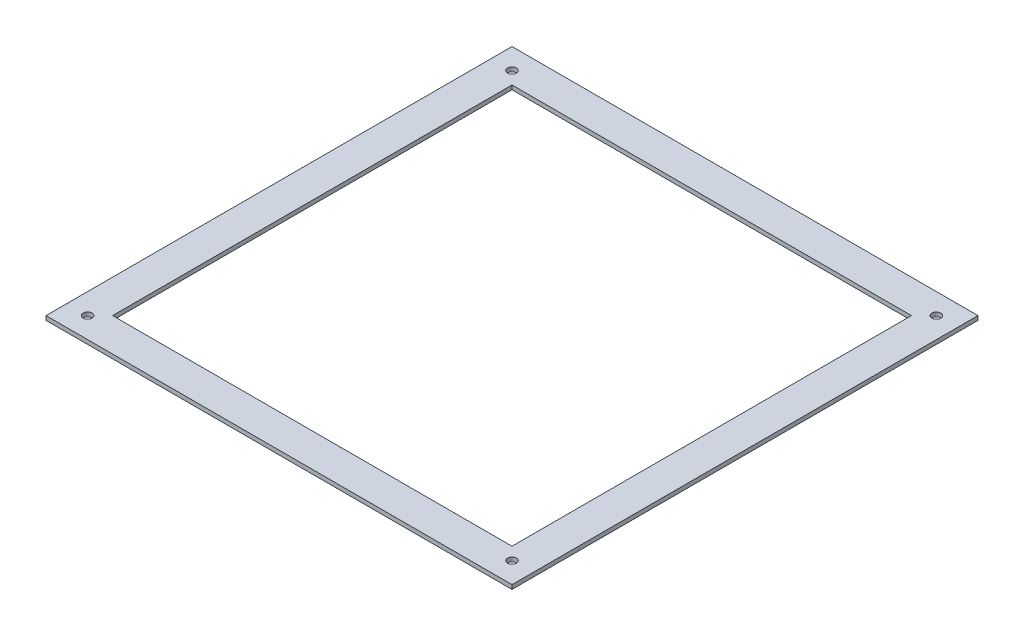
ISO-10303-21;
HEADER;
FILE_DESCRIPTION(('STEP AP214'),'2;1');
FILE_NAME('part.step','',(''),(''),'','','');
FILE_SCHEMA(('AUTOMOTIVE_DESIGN { 1 0 10303 214 1 1 1 1 }'));
ENDSEC;
DATA;
#1=APPLICATION_CONTEXT('core data for automotive mechanical design processes');
#2=APPLICATION_PROTOCOL_DEFINITION('international standard','automotive_design',2000,#1);
#3=PRODUCT_CONTEXT('',#1,'mechanical');
#4=PRODUCT('Part','Part','',(#3));
#5=PRODUCT_RELATED_PRODUCT_CATEGORY('part','',(#4));
#6=PRODUCT_DEFINITION_FORMATION('','',#4);
#7=PRODUCT_DEFINITION_CONTEXT('part definition',#1,'design');
#8=PRODUCT_DEFINITION('design','',#6,#7);
#9=PRODUCT_DEFINITION_SHAPE('','',#8);
#10=(LENGTH_UNIT() NAMED_UNIT(*) SI_UNIT(.MILLI.,.METRE.));
#11=(NAMED_UNIT(*) PLANE_ANGLE_UNIT() SI_UNIT($,.RADIAN.));
#12=(NAMED_UNIT(*) SI_UNIT($,.STERADIAN.) SOLID_ANGLE_UNIT());
#13=UNCERTAINTY_MEASURE_WITH_UNIT(LENGTH_MEASURE(1.E-05),#10,'distance_accuracy_value','');
#14=(GEOMETRIC_REPRESENTATION_CONTEXT(3) GLOBAL_UNCERTAINTY_ASSIGNED_CONTEXT((#13)) GLOBAL_UNIT_ASSIGNED_CONTEXT((#10,
#11,#12)) REPRESENTATION_CONTEXT('',''));
#15=CARTESIAN_POINT('',(0.,0.,0.));
#16=DIRECTION('',(0.,0.,1.));
#17=DIRECTION('',(1.,0.,0.));
#18=AXIS2_PLACEMENT_3D('',#15,#16,#17);
#19=CARTESIAN_POINT('',(177.799999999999,3.175,-177.8));
#20=DIRECTION('',(0.,-1.,0.));
#21=DIRECTION('',(0.,0.,-1.));
#22=AXIS2_PLACEMENT_3D('',#19,#20,#21);
#23=PLANE('',#22);
#24=CARTESIAN_POINT('',(-161.925,3.175,161.925));
#25=DIRECTION('',(0.,1.,0.));
#26=DIRECTION('',(0.,0.,1.));
#27=AXIS2_PLACEMENT_3D('',#24,#25,#26);
#28=CIRCLE('',#27,3.3782);
#29=CARTESIAN_POINT('',(-161.925,3.175,165.3032));
#30=VERTEX_POINT('',#29);
#31=EDGE_CURVE('E238',#30,#30,#28,.T.);
#32=ORIENTED_EDGE('',*,*,#31,.F.);
#33=EDGE_LOOP('',(#32));
#34=FACE_BOUND('',#33,.T.);
#35=CARTESIAN_POINT('',(161.925,3.175,161.925));
#36=DIRECTION('',(0.,1.,0.));
#37=DIRECTION('',(0.,0.,1.));
#38=AXIS2_PLACEMENT_3D('',#35,#36,#37);
#39=CIRCLE('',#38,3.3782);
#40=CARTESIAN_POINT('',(161.925,3.175,165.3032));
#41=VERTEX_POINT('',#40);
#42=EDGE_CURVE('E240',#41,#41,#39,.T.);
#43=ORIENTED_EDGE('',*,*,#42,.F.);
#44=EDGE_LOOP('',(#43));
#45=FACE_BOUND('',#44,.T.);
#46=CARTESIAN_POINT('',(161.925,3.175,-161.925));
#47=DIRECTION('',(0.,1.,0.));
#48=DIRECTION('',(0.,0.,1.));
#49=AXIS2_PLACEMENT_3D('',#46,#47,#48);
#50=CIRCLE('',#49,3.3782);
#51=CARTESIAN_POINT('',(161.925,3.175,-158.5468));
#52=VERTEX_POINT('',#51);
#53=EDGE_CURVE('E247',#52,#52,#50,.T.);
#54=ORIENTED_EDGE('',*,*,#53,.F.);
#55=EDGE_LOOP('',(#54));
#56=FACE_BOUND('',#55,.T.);
#57=CARTESIAN_POINT('',(-161.925,3.175,-161.925));
#58=DIRECTION('',(0.,1.,0.));
#59=DIRECTION('',(0.,0.,1.));
#60=AXIS2_PLACEMENT_3D('',#57,#58,#59);
#61=CIRCLE('',#60,3.3782);
#62=CARTESIAN_POINT('',(-161.925,3.175,-158.5468));
#63=VERTEX_POINT('',#62);
#64=EDGE_CURVE('E253',#63,#63,#61,.T.);
#65=ORIENTED_EDGE('',*,*,#64,.F.);
#66=EDGE_LOOP('',(#65));
#67=FACE_BOUND('',#66,.T.);
#68=DIRECTION('',(0.,0.,-1.));
#69=VECTOR('',#68,1.);
#70=CARTESIAN_POINT('',(177.799999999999,3.175,177.8));
#71=LINE('',#70,#69);
#72=CARTESIAN_POINT('',(177.799999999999,3.175,177.8));
#73=VERTEX_POINT('',#72);
#74=CARTESIAN_POINT('',(177.799999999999,3.175,-177.8));
#75=VERTEX_POINT('',#74);
#76=EDGE_CURVE('E136',#73,#75,#71,.T.);
#77=ORIENTED_EDGE('',*,*,#76,.T.);
#78=DIRECTION('',(-1.,0.,0.));
#79=VECTOR('',#78,1.);
#80=CARTESIAN_POINT('',(-177.799999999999,3.175,-177.8));
#81=LINE('',#80,#79);
#82=CARTESIAN_POINT('',(-177.799999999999,3.175,-177.8));
#83=VERTEX_POINT('',#82);
#84=EDGE_CURVE('E139',#75,#83,#81,.T.);
#85=ORIENTED_EDGE('',*,*,#84,.T.);
#86=DIRECTION('',(0.,0.,1.));
#87=VECTOR('',#86,1.);
#88=CARTESIAN_POINT('',(-177.799999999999,3.175,177.8));
#89=LINE('',#88,#87);
#90=CARTESIAN_POINT('',(-177.799999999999,3.175,177.8));
#91=VERTEX_POINT('',#90);
#92=EDGE_CURVE('E142',#83,#91,#89,.T.);
#93=ORIENTED_EDGE('',*,*,#92,.T.);
#94=DIRECTION('',(1.,0.,0.));
#95=VECTOR('',#94,1.);
#96=CARTESIAN_POINT('',(-177.799999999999,3.175,177.8));
#97=LINE('',#96,#95);
#98=EDGE_CURVE('E144',#91,#73,#97,.T.);
#99=ORIENTED_EDGE('',*,*,#98,.T.);
#100=EDGE_LOOP('',(#77,#85,#93,#99));
#101=FACE_BOUND('',#100,.T.);
#102=DIRECTION('',(0.,0.,-1.));
#103=VECTOR('',#102,1.);
#104=CARTESIAN_POINT('',(152.399999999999,3.175,152.4));
#105=LINE('',#104,#103);
#106=CARTESIAN_POINT('',(152.399999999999,3.175,152.4));
#107=VERTEX_POINT('',#106);
#108=CARTESIAN_POINT('',(152.399999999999,3.175,-152.399999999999));
#109=VERTEX_POINT('',#108);
#110=EDGE_CURVE('E98',#107,#109,#105,.T.);
#111=ORIENTED_EDGE('',*,*,#110,.F.);
#112=DIRECTION('',(1.,0.,0.));
#113=VECTOR('',#112,1.);
#114=CARTESIAN_POINT('',(-152.4,3.175,152.4));
#115=LINE('',#114,#113);
#116=CARTESIAN_POINT('',(-152.4,3.175,152.4));
#117=VERTEX_POINT('',#116);
#118=EDGE_CURVE('E120',#117,#107,#115,.T.);
#119=ORIENTED_EDGE('',*,*,#118,.F.);
#120=DIRECTION('',(0.,0.,1.));
#121=VECTOR('',#120,1.);
#122=CARTESIAN_POINT('',(-152.4,3.175,152.4));
#123=LINE('',#122,#121);
#124=CARTESIAN_POINT('',(-152.4,3.175,-152.4));
#125=VERTEX_POINT('',#124);
#126=EDGE_CURVE('E118',#125,#117,#123,.T.);
#127=ORIENTED_EDGE('',*,*,#126,.F.);
#128=DIRECTION('',(-1.,0.,0.));
#129=VECTOR('',#128,1.);
#130=CARTESIAN_POINT('',(-152.4,3.175,-152.4));
#131=LINE('',#130,#129);
#132=EDGE_CURVE('E106',#109,#125,#131,.T.);
#133=ORIENTED_EDGE('',*,*,#132,.F.);
#134=EDGE_LOOP('',(#111,#119,#127,#133));
#135=FACE_BOUND('',#134,.T.);
#136=ADVANCED_FACE('F32',(#34,#45,#56,#67,#101,#135),#23,.F.);
#137=CARTESIAN_POINT('',(177.799999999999,0.,-177.8));
#138=DIRECTION('',(0.,-1.,0.));
#139=DIRECTION('',(0.,0.,-1.));
#140=AXIS2_PLACEMENT_3D('',#137,#138,#139);
#141=PLANE('',#140);
#142=CARTESIAN_POINT('',(-161.925,0.,161.925));
#143=DIRECTION('',(0.,-1.,0.));
#144=DIRECTION('',(0.,0.,-1.));
#145=AXIS2_PLACEMENT_3D('',#142,#143,#144);
#146=CIRCLE('',#145,3.3782);
#147=CARTESIAN_POINT('',(-161.925,0.,158.5468));
#148=VERTEX_POINT('',#147);
#149=EDGE_CURVE('E36',#148,#148,#146,.T.);
#150=ORIENTED_EDGE('',*,*,#149,.F.);
#151=EDGE_LOOP('',(#150));
#152=FACE_BOUND('',#151,.T.);
#153=CARTESIAN_POINT('',(161.925,0.,161.925));
#154=DIRECTION('',(0.,-1.,0.));
#155=DIRECTION('',(0.,0.,-1.));
#156=AXIS2_PLACEMENT_3D('',#153,#154,#155);
#157=CIRCLE('',#156,3.3782);
#158=CARTESIAN_POINT('',(161.925,0.,158.5468));
#159=VERTEX_POINT('',#158);
#160=EDGE_CURVE('E244',#159,#159,#157,.T.);
#161=ORIENTED_EDGE('',*,*,#160,.F.);
#162=EDGE_LOOP('',(#161));
#163=FACE_BOUND('',#162,.T.);
#164=CARTESIAN_POINT('',(161.925,0.,-161.925));
#165=DIRECTION('',(0.,-1.,0.));
#166=DIRECTION('',(0.,0.,-1.));
#167=AXIS2_PLACEMENT_3D('',#164,#165,#166);
#168=CIRCLE('',#167,3.3782);
#169=CARTESIAN_POINT('',(161.925,0.,-165.3032));
#170=VERTEX_POINT('',#169);
#171=EDGE_CURVE('E250',#170,#170,#168,.T.);
#172=ORIENTED_EDGE('',*,*,#171,.F.);
#173=EDGE_LOOP('',(#172));
#174=FACE_BOUND('',#173,.T.);
#175=CARTESIAN_POINT('',(-161.925,0.,-161.925));
#176=DIRECTION('',(0.,-1.,0.));
#177=DIRECTION('',(0.,0.,-1.));
#178=AXIS2_PLACEMENT_3D('',#175,#176,#177);
#179=CIRCLE('',#178,3.3782);
#180=CARTESIAN_POINT('',(-161.925,0.,-165.3032));
#181=VERTEX_POINT('',#180);
#182=EDGE_CURVE('E126',#181,#181,#179,.T.);
#183=ORIENTED_EDGE('',*,*,#182,.F.);
#184=EDGE_LOOP('',(#183));
#185=FACE_BOUND('',#184,.T.);
#186=DIRECTION('',(0.,0.,-1.));
#187=VECTOR('',#186,1.);
#188=CARTESIAN_POINT('',(177.799999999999,0.,177.8));
#189=LINE('',#188,#187);
#190=CARTESIAN_POINT('',(177.799999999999,0.,177.8));
#191=VERTEX_POINT('',#190);
#192=CARTESIAN_POINT('',(177.799999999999,0.,-177.8));
#193=VERTEX_POINT('',#192);
#194=EDGE_CURVE('E114',#191,#193,#189,.T.);
#195=ORIENTED_EDGE('',*,*,#194,.F.);
#196=DIRECTION('',(1.,0.,0.));
#197=VECTOR('',#196,1.);
#198=CARTESIAN_POINT('',(-177.799999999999,0.,177.8));
#199=LINE('',#198,#197);
#200=CARTESIAN_POINT('',(-177.799999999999,0.,177.8));
#201=VERTEX_POINT('',#200);
#202=EDGE_CURVE('E140',#201,#191,#199,.T.);
#203=ORIENTED_EDGE('',*,*,#202,.F.);
#204=DIRECTION('',(0.,0.,1.));
#205=VECTOR('',#204,1.);
#206=CARTESIAN_POINT('',(-177.799999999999,0.,177.8));
#207=LINE('',#206,#205);
#208=CARTESIAN_POINT('',(-177.799999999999,0.,-177.8));
#209=VERTEX_POINT('',#208);
#210=EDGE_CURVE('E151',#209,#201,#207,.T.);
#211=ORIENTED_EDGE('',*,*,#210,.F.);
#212=DIRECTION('',(-1.,0.,0.));
#213=VECTOR('',#212,1.);
#214=CARTESIAN_POINT('',(-177.799999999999,0.,-177.8));
#215=LINE('',#214,#213);
#216=EDGE_CURVE('E149',#193,#209,#215,.T.);
#217=ORIENTED_EDGE('',*,*,#216,.F.);
#218=EDGE_LOOP('',(#195,#203,#211,#217));
#219=FACE_BOUND('',#218,.T.);
#220=DIRECTION('',(1.,0.,0.));
#221=VECTOR('',#220,1.);
#222=CARTESIAN_POINT('',(-152.4,0.,152.4));
#223=LINE('',#222,#221);
#224=CARTESIAN_POINT('',(-152.4,0.,152.4));
#225=VERTEX_POINT('',#224);
#226=CARTESIAN_POINT('',(152.399999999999,0.,152.4));
#227=VERTEX_POINT('',#226);
#228=EDGE_CURVE('E107',#225,#227,#223,.T.);
#229=ORIENTED_EDGE('',*,*,#228,.T.);
#230=DIRECTION('',(0.,0.,-1.));
#231=VECTOR('',#230,1.);
#232=CARTESIAN_POINT('',(152.399999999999,0.,152.4));
#233=LINE('',#232,#231);
#234=CARTESIAN_POINT('',(152.399999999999,0.,-152.399999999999));
#235=VERTEX_POINT('',#234);
#236=EDGE_CURVE('E56',#227,#235,#233,.T.);
#237=ORIENTED_EDGE('',*,*,#236,.T.);
#238=DIRECTION('',(-1.,0.,0.));
#239=VECTOR('',#238,1.);
#240=CARTESIAN_POINT('',(-152.4,0.,-152.4));
#241=LINE('',#240,#239);
#242=CARTESIAN_POINT('',(-152.4,0.,-152.4));
#243=VERTEX_POINT('',#242);
#244=EDGE_CURVE('E113',#235,#243,#241,.T.);
#245=ORIENTED_EDGE('',*,*,#244,.T.);
#246=DIRECTION('',(0.,0.,1.));
#247=VECTOR('',#246,1.);
#248=CARTESIAN_POINT('',(-152.4,0.,152.4));
#249=LINE('',#248,#247);
#250=EDGE_CURVE('E128',#243,#225,#249,.T.);
#251=ORIENTED_EDGE('',*,*,#250,.T.);
#252=EDGE_LOOP('',(#229,#237,#245,#251));
#253=FACE_BOUND('',#252,.T.);
#254=ADVANCED_FACE('F170',(#152,#163,#174,#185,#219,#253),#141,.T.);
#255=CARTESIAN_POINT('',(177.799999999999,3.175,177.8));
#256=DIRECTION('',(-1.,0.,0.));
#257=DIRECTION('',(0.,0.,1.));
#258=AXIS2_PLACEMENT_3D('',#255,#256,#257);
#259=PLANE('',#258);
#260=ORIENTED_EDGE('',*,*,#194,.T.);
#261=DIRECTION('',(0.,-1.,0.));
#262=VECTOR('',#261,1.);
#263=CARTESIAN_POINT('',(177.799999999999,3.175,-177.8));
#264=LINE('',#263,#262);
#265=EDGE_CURVE('E11',#75,#193,#264,.T.);
#266=ORIENTED_EDGE('',*,*,#265,.F.);
#267=ORIENTED_EDGE('',*,*,#76,.F.);
#268=DIRECTION('',(0.,-1.,0.));
#269=VECTOR('',#268,1.);
#270=CARTESIAN_POINT('',(177.799999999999,3.175,177.8));
#271=LINE('',#270,#269);
#272=EDGE_CURVE('E146',#73,#191,#271,.T.);
#273=ORIENTED_EDGE('',*,*,#272,.T.);
#274=EDGE_LOOP('',(#260,#266,#267,#273));
#275=FACE_BOUND('',#274,.T.);
#276=ADVANCED_FACE('F34',(#275),#259,.F.);
#277=CARTESIAN_POINT('',(-177.799999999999,3.175,-177.8));
#278=DIRECTION('',(0.,0.,1.));
#279=DIRECTION('',(1.,0.,0.));
#280=AXIS2_PLACEMENT_3D('',#277,#278,#279);
#281=PLANE('',#280);
#282=ORIENTED_EDGE('',*,*,#216,.T.);
#283=DIRECTION('',(0.,-1.,0.));
#284=VECTOR('',#283,1.);
#285=CARTESIAN_POINT('',(-177.799999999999,3.175,-177.8));
#286=LINE('',#285,#284);
#287=EDGE_CURVE('E41',#83,#209,#286,.T.);
#288=ORIENTED_EDGE('',*,*,#287,.F.);
#289=ORIENTED_EDGE('',*,*,#84,.F.);
#290=ORIENTED_EDGE('',*,*,#265,.T.);
#291=EDGE_LOOP('',(#282,#288,#289,#290));
#292=FACE_BOUND('',#291,.T.);
#293=ADVANCED_FACE('F180',(#292),#281,.F.);
#294=CARTESIAN_POINT('',(-177.799999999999,3.175,177.8));
#295=DIRECTION('',(1.,0.,0.));
#296=DIRECTION('',(0.,0.,-1.));
#297=AXIS2_PLACEMENT_3D('',#294,#295,#296);
#298=PLANE('',#297);
#299=ORIENTED_EDGE('',*,*,#210,.T.);
#300=DIRECTION('',(0.,-1.,0.));
#301=VECTOR('',#300,1.);
#302=CARTESIAN_POINT('',(-177.799999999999,3.175,177.8));
#303=LINE('',#302,#301);
#304=EDGE_CURVE('E156',#91,#201,#303,.T.);
#305=ORIENTED_EDGE('',*,*,#304,.F.);
#306=ORIENTED_EDGE('',*,*,#92,.F.);
#307=ORIENTED_EDGE('',*,*,#287,.T.);
#308=EDGE_LOOP('',(#299,#305,#306,#307));
#309=FACE_BOUND('',#308,.T.);
#310=ADVANCED_FACE('F164',(#309),#298,.F.);
#311=CARTESIAN_POINT('',(-177.799999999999,3.175,177.8));
#312=DIRECTION('',(0.,0.,-1.));
#313=DIRECTION('',(-1.,0.,0.));
#314=AXIS2_PLACEMENT_3D('',#311,#312,#313);
#315=PLANE('',#314);
#316=ORIENTED_EDGE('',*,*,#202,.T.);
#317=ORIENTED_EDGE('',*,*,#272,.F.);
#318=ORIENTED_EDGE('',*,*,#98,.F.);
#319=ORIENTED_EDGE('',*,*,#304,.T.);
#320=EDGE_LOOP('',(#316,#317,#318,#319));
#321=FACE_BOUND('',#320,.T.);
#322=ADVANCED_FACE('F174',(#321),#315,.F.);
#323=CARTESIAN_POINT('',(152.399999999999,3.175,152.4));
#324=DIRECTION('',(-1.,0.,0.));
#325=DIRECTION('',(0.,0.,1.));
#326=AXIS2_PLACEMENT_3D('',#323,#324,#325);
#327=PLANE('',#326);
#328=ORIENTED_EDGE('',*,*,#236,.F.);
#329=DIRECTION('',(0.,-1.,0.));
#330=VECTOR('',#329,1.);
#331=CARTESIAN_POINT('',(152.399999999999,3.175,152.4));
#332=LINE('',#331,#330);
#333=EDGE_CURVE('E102',#107,#227,#332,.T.);
#334=ORIENTED_EDGE('',*,*,#333,.F.);
#335=ORIENTED_EDGE('',*,*,#110,.T.);
#336=DIRECTION('',(0.,-1.,0.));
#337=VECTOR('',#336,1.);
#338=CARTESIAN_POINT('',(152.399999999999,3.175,-152.399999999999));
#339=LINE('',#338,#337);
#340=EDGE_CURVE('E101',#109,#235,#339,.T.);
#341=ORIENTED_EDGE('',*,*,#340,.T.);
#342=EDGE_LOOP('',(#328,#334,#335,#341));
#343=FACE_BOUND('',#342,.T.);
#344=ADVANCED_FACE('F100',(#343),#327,.T.);
#345=CARTESIAN_POINT('',(-152.4,3.175,-152.4));
#346=DIRECTION('',(0.,0.,1.));
#347=DIRECTION('',(1.,0.,0.));
#348=AXIS2_PLACEMENT_3D('',#345,#346,#347);
#349=PLANE('',#348);
#350=ORIENTED_EDGE('',*,*,#244,.F.);
#351=ORIENTED_EDGE('',*,*,#340,.F.);
#352=ORIENTED_EDGE('',*,*,#132,.T.);
#353=DIRECTION('',(0.,-1.,0.));
#354=VECTOR('',#353,1.);
#355=CARTESIAN_POINT('',(-152.4,3.175,-152.4));
#356=LINE('',#355,#354);
#357=EDGE_CURVE('E115',#125,#243,#356,.T.);
#358=ORIENTED_EDGE('',*,*,#357,.T.);
#359=EDGE_LOOP('',(#350,#351,#352,#358));
#360=FACE_BOUND('',#359,.T.);
#361=ADVANCED_FACE('F110',(#360),#349,.T.);
#362=CARTESIAN_POINT('',(-152.4,3.175,152.4));
#363=DIRECTION('',(1.,0.,0.));
#364=DIRECTION('',(0.,0.,-1.));
#365=AXIS2_PLACEMENT_3D('',#362,#363,#364);
#366=PLANE('',#365);
#367=ORIENTED_EDGE('',*,*,#250,.F.);
#368=ORIENTED_EDGE('',*,*,#357,.F.);
#369=ORIENTED_EDGE('',*,*,#126,.T.);
#370=DIRECTION('',(0.,-1.,0.));
#371=VECTOR('',#370,1.);
#372=CARTESIAN_POINT('',(-152.4,3.175,152.4));
#373=LINE('',#372,#371);
#374=EDGE_CURVE('E48',#117,#225,#373,.T.);
#375=ORIENTED_EDGE('',*,*,#374,.T.);
#376=EDGE_LOOP('',(#367,#368,#369,#375));
#377=FACE_BOUND('',#376,.T.);
#378=ADVANCED_FACE('F207',(#377),#366,.T.);
#379=CARTESIAN_POINT('',(-152.4,3.175,152.4));
#380=DIRECTION('',(0.,0.,-1.));
#381=DIRECTION('',(-1.,0.,0.));
#382=AXIS2_PLACEMENT_3D('',#379,#380,#381);
#383=PLANE('',#382);
#384=ORIENTED_EDGE('',*,*,#228,.F.);
#385=ORIENTED_EDGE('',*,*,#374,.F.);
#386=ORIENTED_EDGE('',*,*,#118,.T.);
#387=ORIENTED_EDGE('',*,*,#333,.T.);
#388=EDGE_LOOP('',(#384,#385,#386,#387));
#389=FACE_BOUND('',#388,.T.);
#390=ADVANCED_FACE('F211',(#389),#383,.T.);
#391=CARTESIAN_POINT('',(-161.925,3.175,-161.925));
#392=DIRECTION('',(0.,1.,0.));
#393=DIRECTION('',(0.,0.,1.));
#394=AXIS2_PLACEMENT_3D('',#391,#392,#393);
#395=CYLINDRICAL_SURFACE('',#394,3.3782);
#396=ORIENTED_EDGE('',*,*,#182,.T.);
#397=EDGE_LOOP('',(#396));
#398=FACE_BOUND('',#397,.T.);
#399=ORIENTED_EDGE('',*,*,#64,.T.);
#400=EDGE_LOOP('',(#399));
#401=FACE_BOUND('',#400,.T.);
#402=ADVANCED_FACE('F217',(#398,#401),#395,.F.);
#403=CARTESIAN_POINT('',(161.925,3.175,-161.925));
#404=DIRECTION('',(0.,1.,0.));
#405=DIRECTION('',(0.,0.,1.));
#406=AXIS2_PLACEMENT_3D('',#403,#404,#405);
#407=CYLINDRICAL_SURFACE('',#406,3.3782);
#408=ORIENTED_EDGE('',*,*,#171,.T.);
#409=EDGE_LOOP('',(#408));
#410=FACE_BOUND('',#409,.T.);
#411=ORIENTED_EDGE('',*,*,#53,.T.);
#412=EDGE_LOOP('',(#411));
#413=FACE_BOUND('',#412,.T.);
#414=ADVANCED_FACE('F220',(#410,#413),#407,.F.);
#415=CARTESIAN_POINT('',(161.925,3.175,161.925));
#416=DIRECTION('',(0.,1.,0.));
#417=DIRECTION('',(0.,0.,1.));
#418=AXIS2_PLACEMENT_3D('',#415,#416,#417);
#419=CYLINDRICAL_SURFACE('',#418,3.3782);
#420=ORIENTED_EDGE('',*,*,#160,.T.);
#421=EDGE_LOOP('',(#420));
#422=FACE_BOUND('',#421,.T.);
#423=ORIENTED_EDGE('',*,*,#42,.T.);
#424=EDGE_LOOP('',(#423));
#425=FACE_BOUND('',#424,.T.);
#426=ADVANCED_FACE('F224',(#422,#425),#419,.F.);
#427=CARTESIAN_POINT('',(-161.925,3.175,161.925));
#428=DIRECTION('',(0.,1.,0.));
#429=DIRECTION('',(0.,0.,1.));
#430=AXIS2_PLACEMENT_3D('',#427,#428,#429);
#431=CYLINDRICAL_SURFACE('',#430,3.3782);
#432=ORIENTED_EDGE('',*,*,#149,.T.);
#433=EDGE_LOOP('',(#432));
#434=FACE_BOUND('',#433,.T.);
#435=ORIENTED_EDGE('',*,*,#31,.T.);
#436=EDGE_LOOP('',(#435));
#437=FACE_BOUND('',#436,.T.);
#438=ADVANCED_FACE('F228',(#434,#437),#431,.F.);
#439=CLOSED_SHELL('',(#136,#254,#276,#293,#310,#322,#344,#361,#378,#390,#402,#414,#426,#438));
#440=MANIFOLD_SOLID_BREP('B2',#439);
#441=ADVANCED_BREP_SHAPE_REPRESENTATION('',(#18,#440),#14);
#442=SHAPE_DEFINITION_REPRESENTATION(#9,#441);
ENDSEC;
END-ISO-10303-21;
